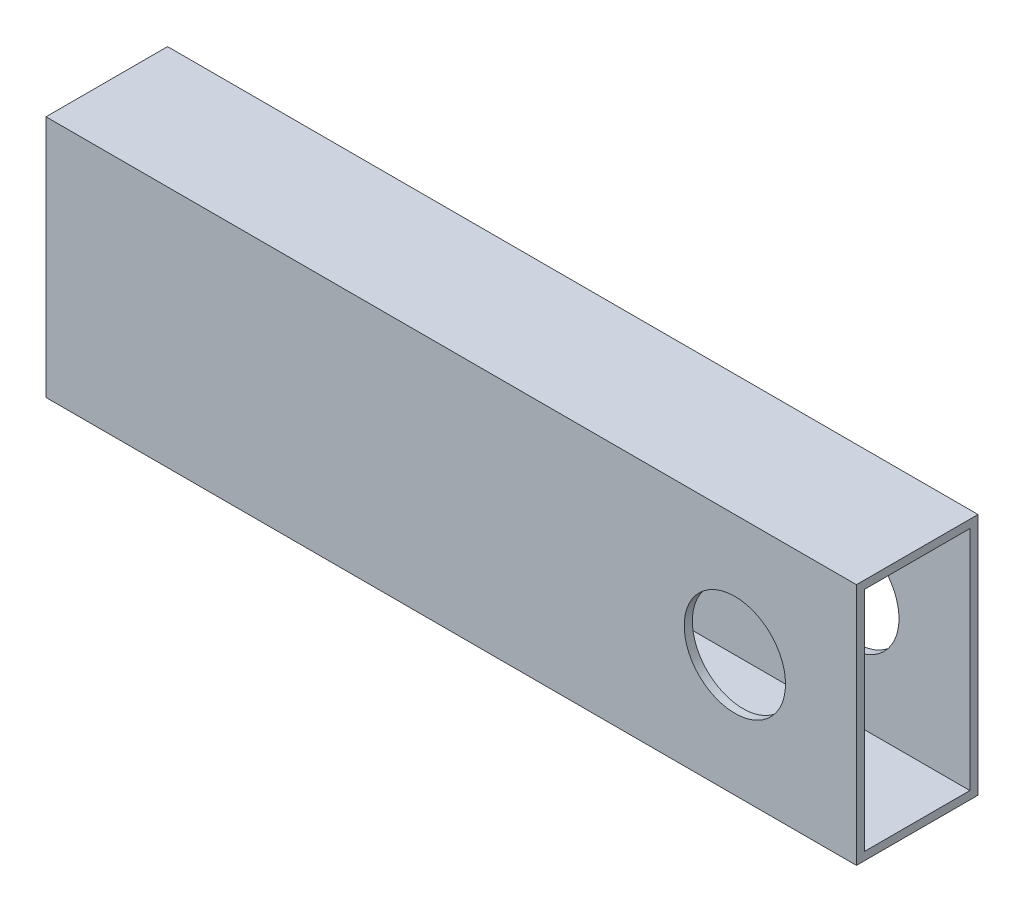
ISO-10303-21;
HEADER;
FILE_DESCRIPTION(('STEP AP214'),'2;1');
FILE_NAME('part.step','',(''),(''),'','','');
FILE_SCHEMA(('AUTOMOTIVE_DESIGN { 1 0 10303 214 1 1 1 1 }'));
ENDSEC;
DATA;
#1=APPLICATION_CONTEXT('core data for automotive mechanical design processes');
#2=APPLICATION_PROTOCOL_DEFINITION('international standard','automotive_design',2000,#1);
#3=PRODUCT_CONTEXT('',#1,'mechanical');
#4=PRODUCT('Part','Part','',(#3));
#5=PRODUCT_RELATED_PRODUCT_CATEGORY('part','',(#4));
#6=PRODUCT_DEFINITION_FORMATION('','',#4);
#7=PRODUCT_DEFINITION_CONTEXT('part definition',#1,'design');
#8=PRODUCT_DEFINITION('design','',#6,#7);
#9=PRODUCT_DEFINITION_SHAPE('','',#8);
#10=(LENGTH_UNIT() NAMED_UNIT(*) SI_UNIT(.MILLI.,.METRE.));
#11=(NAMED_UNIT(*) PLANE_ANGLE_UNIT() SI_UNIT($,.RADIAN.));
#12=(NAMED_UNIT(*) SI_UNIT($,.STERADIAN.) SOLID_ANGLE_UNIT());
#13=UNCERTAINTY_MEASURE_WITH_UNIT(LENGTH_MEASURE(1.E-05),#10,'distance_accuracy_value','');
#14=(GEOMETRIC_REPRESENTATION_CONTEXT(3) GLOBAL_UNCERTAINTY_ASSIGNED_CONTEXT((#13)) GLOBAL_UNIT_ASSIGNED_CONTEXT((#10,
#11,#12)) REPRESENTATION_CONTEXT('',''));
#15=CARTESIAN_POINT('',(0.,0.,0.));
#16=DIRECTION('',(0.,0.,1.));
#17=DIRECTION('',(1.,0.,0.));
#18=AXIS2_PLACEMENT_3D('',#15,#16,#17);
#19=CARTESIAN_POINT('',(170.,30.,30.));
#20=DIRECTION('',(0.,0.,-1.));
#21=DIRECTION('',(-1.,0.,0.));
#22=AXIS2_PLACEMENT_3D('',#19,#20,#21);
#23=CYLINDRICAL_SURFACE('',#22,12.5);
#24=CARTESIAN_POINT('',(170.,30.,28.));
#25=DIRECTION('',(0.,0.,1.));
#26=DIRECTION('',(1.,0.,0.));
#27=AXIS2_PLACEMENT_3D('',#24,#25,#26);
#28=CIRCLE('',#27,12.5);
#29=CARTESIAN_POINT('',(182.5,30.,28.));
#30=VERTEX_POINT('',#29);
#31=EDGE_CURVE('E33',#30,#30,#28,.T.);
#32=ORIENTED_EDGE('',*,*,#31,.F.);
#33=EDGE_LOOP('',(#32));
#34=FACE_BOUND('',#33,.T.);
#35=CARTESIAN_POINT('',(170.,30.,30.));
#36=DIRECTION('',(0.,0.,1.));
#37=DIRECTION('',(1.,0.,0.));
#38=AXIS2_PLACEMENT_3D('',#35,#36,#37);
#39=CIRCLE('',#38,12.5);
#40=CARTESIAN_POINT('',(182.5,30.,30.));
#41=VERTEX_POINT('',#40);
#42=EDGE_CURVE('E138',#41,#41,#39,.T.);
#43=ORIENTED_EDGE('',*,*,#42,.T.);
#44=EDGE_LOOP('',(#43));
#45=FACE_BOUND('',#44,.T.);
#46=ADVANCED_FACE('F29',(#34,#45),#23,.F.);
#47=CARTESIAN_POINT('',(0.,60.,0.));
#48=DIRECTION('',(0.,0.,-1.));
#49=DIRECTION('',(-1.,0.,0.));
#50=AXIS2_PLACEMENT_3D('',#47,#48,#49);
#51=PLANE('',#50);
#52=DIRECTION('',(0.,-1.,0.));
#53=VECTOR('',#52,1.);
#54=CARTESIAN_POINT('',(0.,0.,0.));
#55=LINE('',#54,#53);
#56=CARTESIAN_POINT('',(0.,60.,0.));
#57=VERTEX_POINT('',#56);
#58=CARTESIAN_POINT('',(0.,0.,0.));
#59=VERTEX_POINT('',#58);
#60=EDGE_CURVE('E141',#57,#59,#55,.T.);
#61=ORIENTED_EDGE('',*,*,#60,.F.);
#62=DIRECTION('',(-1.,0.,0.));
#63=VECTOR('',#62,1.);
#64=CARTESIAN_POINT('',(0.,60.,0.));
#65=LINE('',#64,#63);
#66=CARTESIAN_POINT('',(200.,60.,0.));
#67=VERTEX_POINT('',#66);
#68=EDGE_CURVE('E148',#67,#57,#65,.T.);
#69=ORIENTED_EDGE('',*,*,#68,.F.);
#70=DIRECTION('',(0.,1.,0.));
#71=VECTOR('',#70,1.);
#72=CARTESIAN_POINT('',(200.,0.,0.));
#73=LINE('',#72,#71);
#74=CARTESIAN_POINT('',(200.,0.,0.));
#75=VERTEX_POINT('',#74);
#76=EDGE_CURVE('E146',#75,#67,#73,.T.);
#77=ORIENTED_EDGE('',*,*,#76,.F.);
#78=DIRECTION('',(1.,0.,0.));
#79=VECTOR('',#78,1.);
#80=CARTESIAN_POINT('',(0.,0.,0.));
#81=LINE('',#80,#79);
#82=EDGE_CURVE('E144',#59,#75,#81,.T.);
#83=ORIENTED_EDGE('',*,*,#82,.F.);
#84=EDGE_LOOP('',(#61,#69,#77,#83));
#85=FACE_BOUND('',#84,.T.);
#86=CARTESIAN_POINT('',(170.,30.,0.));
#87=DIRECTION('',(0.,0.,1.));
#88=DIRECTION('',(1.,0.,0.));
#89=AXIS2_PLACEMENT_3D('',#86,#87,#88);
#90=CIRCLE('',#89,12.5);
#91=CARTESIAN_POINT('',(182.5,30.,0.));
#92=VERTEX_POINT('',#91);
#93=EDGE_CURVE('E135',#92,#92,#90,.T.);
#94=ORIENTED_EDGE('',*,*,#93,.T.);
#95=EDGE_LOOP('',(#94));
#96=FACE_BOUND('',#95,.T.);
#97=ADVANCED_FACE('F176',(#85,#96),#51,.T.);
#98=CARTESIAN_POINT('',(0.,60.,30.));
#99=DIRECTION('',(0.,0.,-1.));
#100=DIRECTION('',(-1.,0.,0.));
#101=AXIS2_PLACEMENT_3D('',#98,#99,#100);
#102=PLANE('',#101);
#103=DIRECTION('',(0.,-1.,0.));
#104=VECTOR('',#103,1.);
#105=CARTESIAN_POINT('',(0.,0.,30.));
#106=LINE('',#105,#104);
#107=CARTESIAN_POINT('',(0.,60.,30.));
#108=VERTEX_POINT('',#107);
#109=CARTESIAN_POINT('',(0.,0.,30.));
#110=VERTEX_POINT('',#109);
#111=EDGE_CURVE('E150',#108,#110,#106,.T.);
#112=ORIENTED_EDGE('',*,*,#111,.T.);
#113=DIRECTION('',(1.,0.,0.));
#114=VECTOR('',#113,1.);
#115=CARTESIAN_POINT('',(0.,0.,30.));
#116=LINE('',#115,#114);
#117=CARTESIAN_POINT('',(200.,0.,30.));
#118=VERTEX_POINT('',#117);
#119=EDGE_CURVE('E153',#110,#118,#116,.T.);
#120=ORIENTED_EDGE('',*,*,#119,.T.);
#121=DIRECTION('',(0.,1.,0.));
#122=VECTOR('',#121,1.);
#123=CARTESIAN_POINT('',(200.,0.,30.));
#124=LINE('',#123,#122);
#125=CARTESIAN_POINT('',(200.,60.,30.));
#126=VERTEX_POINT('',#125);
#127=EDGE_CURVE('E155',#118,#126,#124,.T.);
#128=ORIENTED_EDGE('',*,*,#127,.T.);
#129=DIRECTION('',(-1.,0.,0.));
#130=VECTOR('',#129,1.);
#131=CARTESIAN_POINT('',(0.,60.,30.));
#132=LINE('',#131,#130);
#133=EDGE_CURVE('E157',#126,#108,#132,.T.);
#134=ORIENTED_EDGE('',*,*,#133,.T.);
#135=EDGE_LOOP('',(#112,#120,#128,#134));
#136=FACE_BOUND('',#135,.T.);
#137=ORIENTED_EDGE('',*,*,#42,.F.);
#138=EDGE_LOOP('',(#137));
#139=FACE_BOUND('',#138,.T.);
#140=ADVANCED_FACE('F181',(#136,#139),#102,.F.);
#141=CARTESIAN_POINT('',(0.,0.,30.));
#142=DIRECTION('',(1.,0.,0.));
#143=DIRECTION('',(0.,0.,-1.));
#144=AXIS2_PLACEMENT_3D('',#141,#142,#143);
#145=PLANE('',#144);
#146=DIRECTION('',(0.,0.,1.));
#147=VECTOR('',#146,1.);
#148=CARTESIAN_POINT('',(0.,58.,2.));
#149=LINE('',#148,#147);
#150=CARTESIAN_POINT('',(0.,58.,2.));
#151=VERTEX_POINT('',#150);
#152=CARTESIAN_POINT('',(0.,58.,28.));
#153=VERTEX_POINT('',#152);
#154=EDGE_CURVE('E103',#151,#153,#149,.T.);
#155=ORIENTED_EDGE('',*,*,#154,.T.);
#156=DIRECTION('',(0.,-1.,0.));
#157=VECTOR('',#156,1.);
#158=CARTESIAN_POINT('',(0.,58.,28.));
#159=LINE('',#158,#157);
#160=CARTESIAN_POINT('',(0.,2.,28.));
#161=VERTEX_POINT('',#160);
#162=EDGE_CURVE('E46',#153,#161,#159,.T.);
#163=ORIENTED_EDGE('',*,*,#162,.T.);
#164=DIRECTION('',(0.,0.,-1.));
#165=VECTOR('',#164,1.);
#166=CARTESIAN_POINT('',(0.,2.,28.));
#167=LINE('',#166,#165);
#168=CARTESIAN_POINT('',(0.,2.,2.));
#169=VERTEX_POINT('',#168);
#170=EDGE_CURVE('E120',#161,#169,#167,.T.);
#171=ORIENTED_EDGE('',*,*,#170,.T.);
#172=DIRECTION('',(0.,1.,0.));
#173=VECTOR('',#172,1.);
#174=CARTESIAN_POINT('',(0.,2.,2.));
#175=LINE('',#174,#173);
#176=EDGE_CURVE('E126',#169,#151,#175,.T.);
#177=ORIENTED_EDGE('',*,*,#176,.T.);
#178=EDGE_LOOP('',(#155,#163,#171,#177));
#179=FACE_BOUND('',#178,.T.);
#180=ORIENTED_EDGE('',*,*,#60,.T.);
#181=DIRECTION('',(0.,0.,-1.));
#182=VECTOR('',#181,1.);
#183=CARTESIAN_POINT('',(0.,0.,30.));
#184=LINE('',#183,#182);
#185=EDGE_CURVE('E11',#110,#59,#184,.T.);
#186=ORIENTED_EDGE('',*,*,#185,.F.);
#187=ORIENTED_EDGE('',*,*,#111,.F.);
#188=DIRECTION('',(0.,0.,-1.));
#189=VECTOR('',#188,1.);
#190=CARTESIAN_POINT('',(0.,60.,30.));
#191=LINE('',#190,#189);
#192=EDGE_CURVE('E159',#108,#57,#191,.T.);
#193=ORIENTED_EDGE('',*,*,#192,.T.);
#194=EDGE_LOOP('',(#180,#186,#187,#193));
#195=FACE_BOUND('',#194,.T.);
#196=ADVANCED_FACE('F31',(#179,#195),#145,.F.);
#197=CARTESIAN_POINT('',(0.,0.,30.));
#198=DIRECTION('',(0.,1.,0.));
#199=DIRECTION('',(0.,0.,1.));
#200=AXIS2_PLACEMENT_3D('',#197,#198,#199);
#201=PLANE('',#200);
#202=ORIENTED_EDGE('',*,*,#82,.T.);
#203=DIRECTION('',(0.,0.,-1.));
#204=VECTOR('',#203,1.);
#205=CARTESIAN_POINT('',(200.,0.,30.));
#206=LINE('',#205,#204);
#207=EDGE_CURVE('E38',#118,#75,#206,.T.);
#208=ORIENTED_EDGE('',*,*,#207,.F.);
#209=ORIENTED_EDGE('',*,*,#119,.F.);
#210=ORIENTED_EDGE('',*,*,#185,.T.);
#211=EDGE_LOOP('',(#202,#208,#209,#210));
#212=FACE_BOUND('',#211,.T.);
#213=ADVANCED_FACE('F189',(#212),#201,.F.);
#214=CARTESIAN_POINT('',(200.,0.,30.));
#215=DIRECTION('',(-1.,0.,0.));
#216=DIRECTION('',(0.,0.,1.));
#217=AXIS2_PLACEMENT_3D('',#214,#215,#216);
#218=PLANE('',#217);
#219=DIRECTION('',(0.,1.,0.));
#220=VECTOR('',#219,1.);
#221=CARTESIAN_POINT('',(200.,2.,2.));
#222=LINE('',#221,#220);
#223=CARTESIAN_POINT('',(200.,2.,2.));
#224=VERTEX_POINT('',#223);
#225=CARTESIAN_POINT('',(200.,58.,2.));
#226=VERTEX_POINT('',#225);
#227=EDGE_CURVE('E111',#224,#226,#222,.T.);
#228=ORIENTED_EDGE('',*,*,#227,.F.);
#229=DIRECTION('',(0.,0.,-1.));
#230=VECTOR('',#229,1.);
#231=CARTESIAN_POINT('',(200.,2.,28.));
#232=LINE('',#231,#230);
#233=CARTESIAN_POINT('',(200.,2.,28.));
#234=VERTEX_POINT('',#233);
#235=EDGE_CURVE('E54',#234,#224,#232,.T.);
#236=ORIENTED_EDGE('',*,*,#235,.F.);
#237=DIRECTION('',(0.,-1.,0.));
#238=VECTOR('',#237,1.);
#239=CARTESIAN_POINT('',(200.,58.,28.));
#240=LINE('',#239,#238);
#241=CARTESIAN_POINT('',(200.,58.,28.));
#242=VERTEX_POINT('',#241);
#243=EDGE_CURVE('E118',#242,#234,#240,.T.);
#244=ORIENTED_EDGE('',*,*,#243,.F.);
#245=DIRECTION('',(0.,0.,1.));
#246=VECTOR('',#245,1.);
#247=CARTESIAN_POINT('',(200.,58.,2.));
#248=LINE('',#247,#246);
#249=EDGE_CURVE('E100',#226,#242,#248,.T.);
#250=ORIENTED_EDGE('',*,*,#249,.F.);
#251=EDGE_LOOP('',(#228,#236,#244,#250));
#252=FACE_BOUND('',#251,.T.);
#253=ORIENTED_EDGE('',*,*,#76,.T.);
#254=DIRECTION('',(0.,0.,-1.));
#255=VECTOR('',#254,1.);
#256=CARTESIAN_POINT('',(200.,60.,30.));
#257=LINE('',#256,#255);
#258=EDGE_CURVE('E162',#126,#67,#257,.T.);
#259=ORIENTED_EDGE('',*,*,#258,.F.);
#260=ORIENTED_EDGE('',*,*,#127,.F.);
#261=ORIENTED_EDGE('',*,*,#207,.T.);
#262=EDGE_LOOP('',(#253,#259,#260,#261));
#263=FACE_BOUND('',#262,.T.);
#264=ADVANCED_FACE('F115',(#252,#263),#218,.F.);
#265=CARTESIAN_POINT('',(0.,60.,30.));
#266=DIRECTION('',(0.,-1.,0.));
#267=DIRECTION('',(0.,0.,-1.));
#268=AXIS2_PLACEMENT_3D('',#265,#266,#267);
#269=PLANE('',#268);
#270=ORIENTED_EDGE('',*,*,#68,.T.);
#271=ORIENTED_EDGE('',*,*,#192,.F.);
#272=ORIENTED_EDGE('',*,*,#133,.F.);
#273=ORIENTED_EDGE('',*,*,#258,.T.);
#274=EDGE_LOOP('',(#270,#271,#272,#273));
#275=FACE_BOUND('',#274,.T.);
#276=ADVANCED_FACE('F194',(#275),#269,.F.);
#277=CARTESIAN_POINT('',(170.,30.,2.));
#278=DIRECTION('',(0.,0.,-1.));
#279=DIRECTION('',(-1.,0.,0.));
#280=AXIS2_PLACEMENT_3D('',#277,#278,#279);
#281=CIRCLE('',#280,12.5);
#282=CARTESIAN_POINT('',(157.5,30.,2.));
#283=VERTEX_POINT('',#282);
#284=EDGE_CURVE('E132',#283,#283,#281,.T.);
#285=ORIENTED_EDGE('',*,*,#284,.F.);
#286=EDGE_LOOP('',(#285));
#287=FACE_BOUND('',#286,.T.);
#288=ORIENTED_EDGE('',*,*,#93,.F.);
#289=EDGE_LOOP('',(#288));
#290=FACE_BOUND('',#289,.T.);
#291=ADVANCED_FACE('F178',(#287,#290),#23,.F.);
#292=CARTESIAN_POINT('',(0.,2.,28.));
#293=DIRECTION('',(0.,-1.,0.));
#294=DIRECTION('',(0.,0.,-1.));
#295=AXIS2_PLACEMENT_3D('',#292,#293,#294);
#296=PLANE('',#295);
#297=ORIENTED_EDGE('',*,*,#235,.T.);
#298=DIRECTION('',(1.,0.,0.));
#299=VECTOR('',#298,1.);
#300=CARTESIAN_POINT('',(0.,2.,2.));
#301=LINE('',#300,#299);
#302=EDGE_CURVE('E108',#169,#224,#301,.T.);
#303=ORIENTED_EDGE('',*,*,#302,.F.);
#304=ORIENTED_EDGE('',*,*,#170,.F.);
#305=DIRECTION('',(1.,0.,0.));
#306=VECTOR('',#305,1.);
#307=CARTESIAN_POINT('',(0.,2.,28.));
#308=LINE('',#307,#306);
#309=EDGE_CURVE('E130',#161,#234,#308,.T.);
#310=ORIENTED_EDGE('',*,*,#309,.T.);
#311=EDGE_LOOP('',(#297,#303,#304,#310));
#312=FACE_BOUND('',#311,.T.);
#313=ADVANCED_FACE('F218',(#312),#296,.F.);
#314=CARTESIAN_POINT('',(0.,58.,28.));
#315=DIRECTION('',(0.,0.,1.));
#316=DIRECTION('',(1.,0.,0.));
#317=AXIS2_PLACEMENT_3D('',#314,#315,#316);
#318=PLANE('',#317);
#319=ORIENTED_EDGE('',*,*,#31,.T.);
#320=EDGE_LOOP('',(#319));
#321=FACE_BOUND('',#320,.T.);
#322=ORIENTED_EDGE('',*,*,#243,.T.);
#323=ORIENTED_EDGE('',*,*,#309,.F.);
#324=ORIENTED_EDGE('',*,*,#162,.F.);
#325=DIRECTION('',(1.,0.,0.));
#326=VECTOR('',#325,1.);
#327=CARTESIAN_POINT('',(0.,58.,28.));
#328=LINE('',#327,#326);
#329=EDGE_CURVE('E107',#153,#242,#328,.T.);
#330=ORIENTED_EDGE('',*,*,#329,.T.);
#331=EDGE_LOOP('',(#322,#323,#324,#330));
#332=FACE_BOUND('',#331,.T.);
#333=ADVANCED_FACE('F172',(#321,#332),#318,.F.);
#334=CARTESIAN_POINT('',(0.,58.,2.));
#335=DIRECTION('',(0.,1.,0.));
#336=DIRECTION('',(0.,0.,1.));
#337=AXIS2_PLACEMENT_3D('',#334,#335,#336);
#338=PLANE('',#337);
#339=ORIENTED_EDGE('',*,*,#249,.T.);
#340=ORIENTED_EDGE('',*,*,#329,.F.);
#341=ORIENTED_EDGE('',*,*,#154,.F.);
#342=DIRECTION('',(1.,0.,0.));
#343=VECTOR('',#342,1.);
#344=CARTESIAN_POINT('',(0.,58.,2.));
#345=LINE('',#344,#343);
#346=EDGE_CURVE('E96',#151,#226,#345,.T.);
#347=ORIENTED_EDGE('',*,*,#346,.T.);
#348=EDGE_LOOP('',(#339,#340,#341,#347));
#349=FACE_BOUND('',#348,.T.);
#350=ADVANCED_FACE('F98',(#349),#338,.F.);
#351=CARTESIAN_POINT('',(0.,2.,2.));
#352=DIRECTION('',(0.,0.,-1.));
#353=DIRECTION('',(-1.,0.,0.));
#354=AXIS2_PLACEMENT_3D('',#351,#352,#353);
#355=PLANE('',#354);
#356=ORIENTED_EDGE('',*,*,#284,.T.);
#357=EDGE_LOOP('',(#356));
#358=FACE_BOUND('',#357,.T.);
#359=ORIENTED_EDGE('',*,*,#227,.T.);
#360=ORIENTED_EDGE('',*,*,#346,.F.);
#361=ORIENTED_EDGE('',*,*,#176,.F.);
#362=ORIENTED_EDGE('',*,*,#302,.T.);
#363=EDGE_LOOP('',(#359,#360,#361,#362));
#364=FACE_BOUND('',#363,.T.);
#365=ADVANCED_FACE('F112',(#358,#364),#355,.F.);
#366=CLOSED_SHELL('',(#46,#97,#140,#196,#213,#264,#276,#291,#313,#333,#350,#365));
#367=MANIFOLD_SOLID_BREP('B2',#366);
#368=ADVANCED_BREP_SHAPE_REPRESENTATION('',(#18,#367),#14);
#369=SHAPE_DEFINITION_REPRESENTATION(#9,#368);
ENDSEC;
END-ISO-10303-21;
